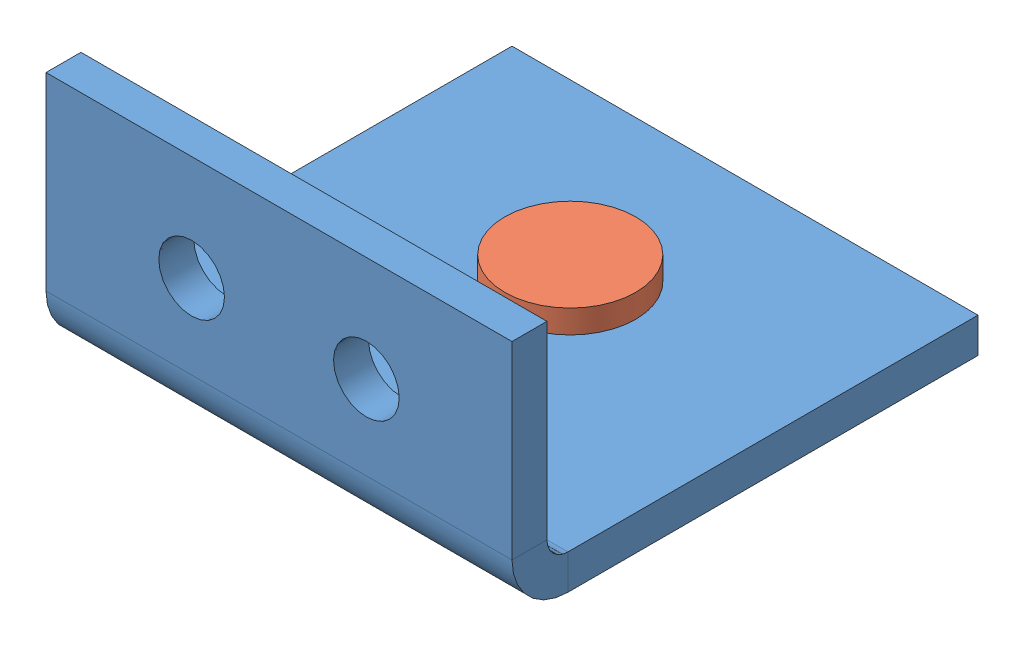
SolidWorks assembly Coils Stop ASSY A-8037.SLDASM, configuration Default (file format 6000). Lengths in mm.
Overall size (25.4 18.12 25.4).
2 component instances, 2 part files, 2 mates.
Components (placement in the parent):
- Coil Sop BKt-1: Coil Sop BKt.SLDPRT [Default] at (-33.7598 -11.6618 33.8991) size (25.4 13.36 25.4)
- Coil Stop Button SYS7 Misc A-1: Coil Stop Button SYS7 Misc A.SLDPRT [Default] at (-33.7598 -11.6618 18.0241) x (1 0 0) z (0 1 0) size (11.18 11.18 7.94)
Mates (geometry in assembly coordinates):
- Concentric1: concentric aligned: cylinder of Coil Sop BKt-1 through (-33.7598 -9.7568 18.0241) axis (0 -1 0) radius 3.5687; cylinder of Coil Stop Button SYS7 Misc A-1 through (-33.7598 -8.4868 18.0241) axis (0 -1 0) radius 3.5687
- Coincident1: coincident anti-aligned: plane of Coil Sop BKt-1 through (-21.0598 -11.6618 33.8991) normal (0 -1 0); plane of Coil Stop Button SYS7 Misc A-1 through (-33.7598 -11.6618 18.0241) normal (0 1 0)
